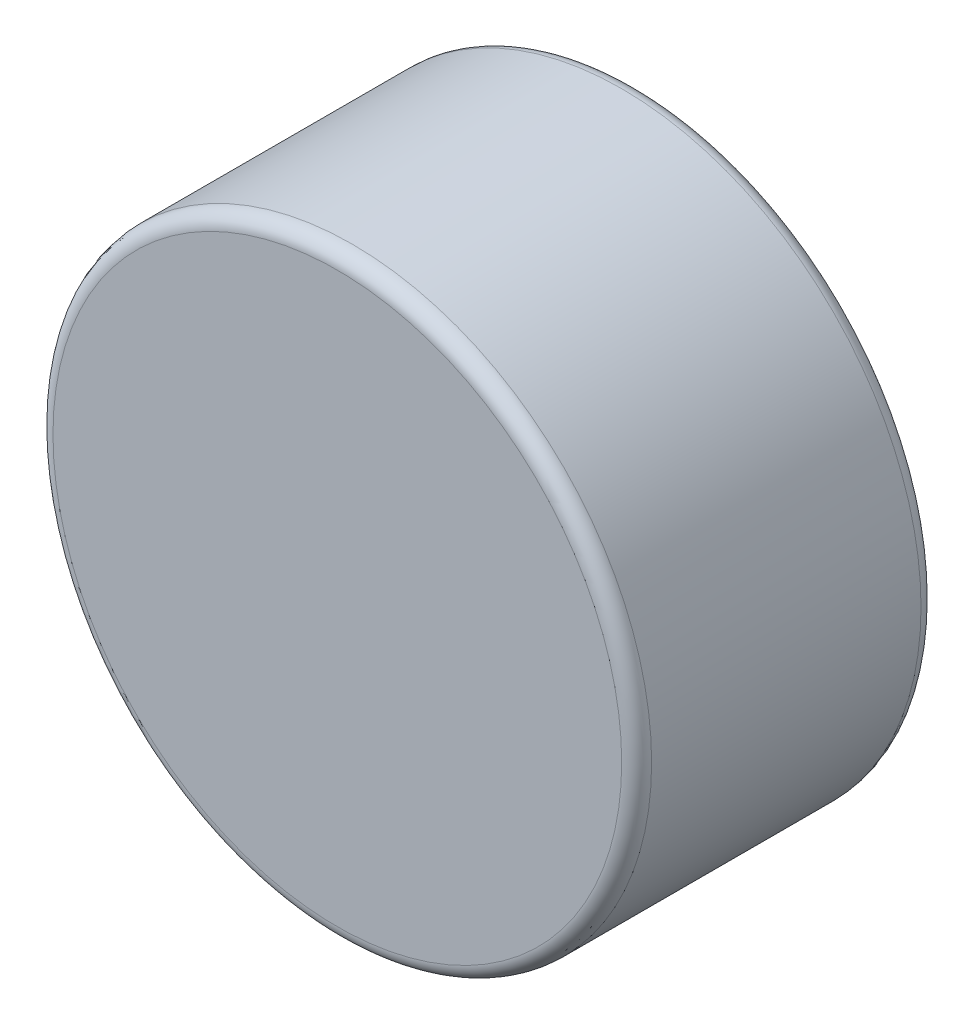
ISO-10303-21;
HEADER;
FILE_DESCRIPTION(('STEP AP214'),'2;1');
FILE_NAME('part.step','',(''),(''),'','','');
FILE_SCHEMA(('AUTOMOTIVE_DESIGN { 1 0 10303 214 1 1 1 1 }'));
ENDSEC;
DATA;
#1=APPLICATION_CONTEXT('core data for automotive mechanical design processes');
#2=APPLICATION_PROTOCOL_DEFINITION('international standard','automotive_design',2000,#1);
#3=PRODUCT_CONTEXT('',#1,'mechanical');
#4=PRODUCT('Part','Part','',(#3));
#5=PRODUCT_RELATED_PRODUCT_CATEGORY('part','',(#4));
#6=PRODUCT_DEFINITION_FORMATION('','',#4);
#7=PRODUCT_DEFINITION_CONTEXT('part definition',#1,'design');
#8=PRODUCT_DEFINITION('design','',#6,#7);
#9=PRODUCT_DEFINITION_SHAPE('','',#8);
#10=(LENGTH_UNIT() NAMED_UNIT(*) SI_UNIT(.MILLI.,.METRE.));
#11=(NAMED_UNIT(*) PLANE_ANGLE_UNIT() SI_UNIT($,.RADIAN.));
#12=(NAMED_UNIT(*) SI_UNIT($,.STERADIAN.) SOLID_ANGLE_UNIT());
#13=UNCERTAINTY_MEASURE_WITH_UNIT(LENGTH_MEASURE(1.E-05),#10,'distance_accuracy_value','');
#14=(GEOMETRIC_REPRESENTATION_CONTEXT(3) GLOBAL_UNCERTAINTY_ASSIGNED_CONTEXT((#13)) GLOBAL_UNIT_ASSIGNED_CONTEXT((#10,
#11,#12)) REPRESENTATION_CONTEXT('',''));
#15=CARTESIAN_POINT('',(0.,0.,0.));
#16=DIRECTION('',(0.,0.,1.));
#17=DIRECTION('',(1.,0.,0.));
#18=AXIS2_PLACEMENT_3D('',#15,#16,#17);
#19=CARTESIAN_POINT('',(0.,0.,5.));
#20=DIRECTION('',(0.,0.,-1.));
#21=DIRECTION('',(-1.,0.,0.));
#22=AXIS2_PLACEMENT_3D('',#19,#20,#21);
#23=CYLINDRICAL_SURFACE('',#22,10.);
#24=CARTESIAN_POINT('',(0.,0.,-4.5));
#25=DIRECTION('',(0.,0.,1.));
#26=DIRECTION('',(1.,0.,0.));
#27=AXIS2_PLACEMENT_3D('',#24,#25,#26);
#28=CIRCLE('',#27,10.);
#29=CARTESIAN_POINT('',(10.,0.,-4.5));
#30=VERTEX_POINT('',#29);
#31=EDGE_CURVE('E39',#30,#30,#28,.T.);
#32=ORIENTED_EDGE('',*,*,#31,.T.);
#33=EDGE_LOOP('',(#32));
#34=FACE_BOUND('',#33,.T.);
#35=CARTESIAN_POINT('',(0.,0.,4.5));
#36=DIRECTION('',(0.,0.,1.));
#37=DIRECTION('',(1.,0.,0.));
#38=AXIS2_PLACEMENT_3D('',#35,#36,#37);
#39=CIRCLE('',#38,10.);
#40=CARTESIAN_POINT('',(10.,0.,4.5));
#41=VERTEX_POINT('',#40);
#42=EDGE_CURVE('E43',#41,#41,#39,.F.);
#43=ORIENTED_EDGE('',*,*,#42,.T.);
#44=EDGE_LOOP('',(#43));
#45=FACE_BOUND('',#44,.T.);
#46=ADVANCED_FACE('F28',(#34,#45),#23,.T.);
#47=CARTESIAN_POINT('',(0.,0.,5.));
#48=DIRECTION('',(0.,0.,1.));
#49=DIRECTION('',(1.,0.,0.));
#50=AXIS2_PLACEMENT_3D('',#47,#48,#49);
#51=PLANE('',#50);
#52=CARTESIAN_POINT('',(0.,0.,5.));
#53=DIRECTION('',(0.,0.,1.));
#54=DIRECTION('',(1.,0.,0.));
#55=AXIS2_PLACEMENT_3D('',#52,#53,#54);
#56=CIRCLE('',#55,9.5);
#57=CARTESIAN_POINT('',(9.5,0.,5.));
#58=VERTEX_POINT('',#57);
#59=EDGE_CURVE('E10',#58,#58,#56,.T.);
#60=ORIENTED_EDGE('',*,*,#59,.T.);
#61=EDGE_LOOP('',(#60));
#62=FACE_BOUND('',#61,.T.);
#63=ADVANCED_FACE('F59',(#62),#51,.T.);
#64=CARTESIAN_POINT('',(0.,0.,-5.));
#65=DIRECTION('',(0.,0.,1.));
#66=DIRECTION('',(1.,0.,0.));
#67=AXIS2_PLACEMENT_3D('',#64,#65,#66);
#68=PLANE('',#67);
#69=CARTESIAN_POINT('',(0.,0.,-5.));
#70=DIRECTION('',(0.,0.,1.));
#71=DIRECTION('',(1.,0.,0.));
#72=AXIS2_PLACEMENT_3D('',#69,#70,#71);
#73=CIRCLE('',#72,9.5);
#74=CARTESIAN_POINT('',(9.5,0.,-5.));
#75=VERTEX_POINT('',#74);
#76=EDGE_CURVE('E35',#75,#75,#73,.F.);
#77=ORIENTED_EDGE('',*,*,#76,.T.);
#78=EDGE_LOOP('',(#77));
#79=FACE_BOUND('',#78,.T.);
#80=ADVANCED_FACE('F56',(#79),#68,.F.);
#81=CARTESIAN_POINT('',(0.,0.,-4.5));
#82=DIRECTION('',(0.,0.,1.));
#83=DIRECTION('',(1.,0.,0.));
#84=AXIS2_PLACEMENT_3D('',#81,#82,#83);
#85=TOROIDAL_SURFACE('',#84,9.5,0.5);
#86=ORIENTED_EDGE('',*,*,#76,.F.);
#87=EDGE_LOOP('',(#86));
#88=FACE_BOUND('',#87,.T.);
#89=ORIENTED_EDGE('',*,*,#31,.F.);
#90=EDGE_LOOP('',(#89));
#91=FACE_BOUND('',#90,.T.);
#92=ADVANCED_FACE('F52',(#88,#91),#85,.T.);
#93=CARTESIAN_POINT('',(0.,0.,4.5));
#94=DIRECTION('',(0.,0.,1.));
#95=DIRECTION('',(1.,0.,0.));
#96=AXIS2_PLACEMENT_3D('',#93,#94,#95);
#97=TOROIDAL_SURFACE('',#96,9.5,0.5);
#98=ORIENTED_EDGE('',*,*,#42,.F.);
#99=EDGE_LOOP('',(#98));
#100=FACE_BOUND('',#99,.T.);
#101=ORIENTED_EDGE('',*,*,#59,.F.);
#102=EDGE_LOOP('',(#101));
#103=FACE_BOUND('',#102,.T.);
#104=ADVANCED_FACE('F30',(#100,#103),#97,.T.);
#105=CLOSED_SHELL('',(#46,#63,#80,#92,#104));
#106=MANIFOLD_SOLID_BREP('B2',#105);
#107=ADVANCED_BREP_SHAPE_REPRESENTATION('',(#18,#106),#14);
#108=SHAPE_DEFINITION_REPRESENTATION(#9,#107);
ENDSEC;
END-ISO-10303-21;
